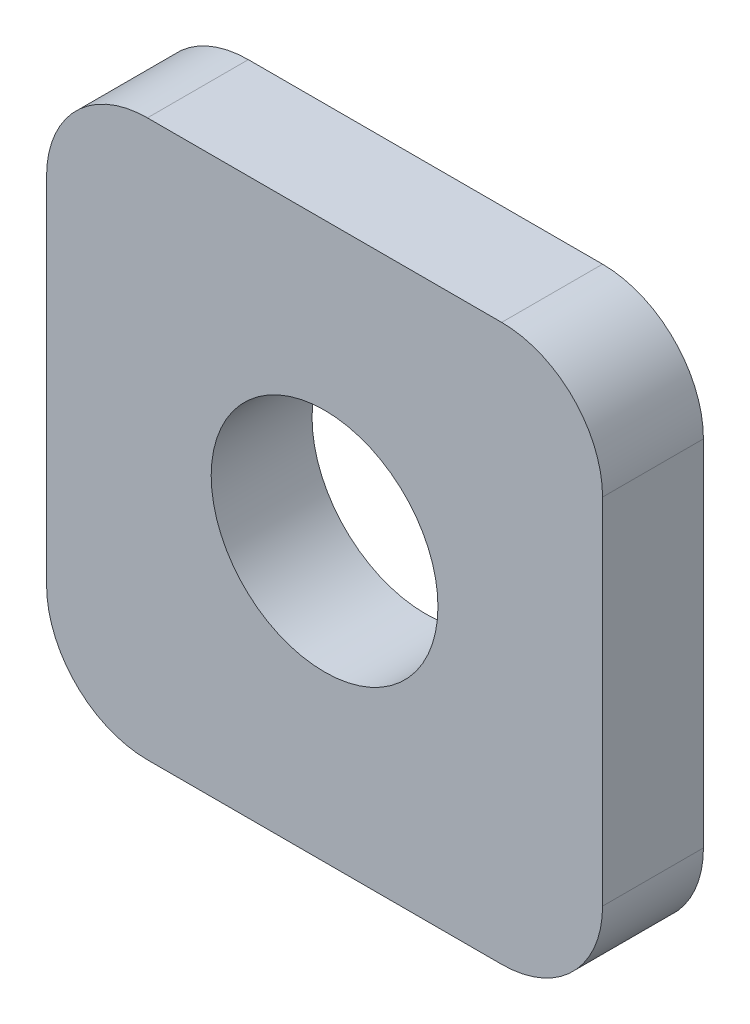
from build123d import *

# Parameters (mm, degrees)
SKETCH1_R           = 7.1374
BOSS_EXTRUDE1_DEPTH = 3.175


with BuildPart() as part:
    # Sketch1 → Boss-Extrude1 (new, symmetric)
    with BuildSketch(Plane(origin=(0, 0, 0), x_dir=(0, 1, 0), z_dir=(0, 0, 1))):
        with BuildLine():
            Line((-11.15, 17.5), (11.15, 17.5))
            ThreePointArc((11.15, 17.5), (15.640128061, 15.640128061), (17.5, 11.15))
            Line((17.5, 11.15), (17.5, -11.15))
            ThreePointArc((17.5, -11.15), (15.640128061, -15.640128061), (11.15, -17.5))
            Line((11.15, -17.5), (-11.15, -17.5))
            ThreePointArc((-11.15, -17.5), (-15.640128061, -15.640128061), (-17.5, -11.15))
            Line((-17.5, -11.15), (-17.5, 11.15))
            ThreePointArc((-17.5, 11.15), (-15.640128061, 15.640128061), (-11.15, 17.5))
        make_face()
        with Locations(Location((0, 0, 0), (0, 0, 270))):
            Circle(SKETCH1_R, mode=Mode.SUBTRACT)
    extrude(amount=BOSS_EXTRUDE1_DEPTH, both=True)


solid = part.part
